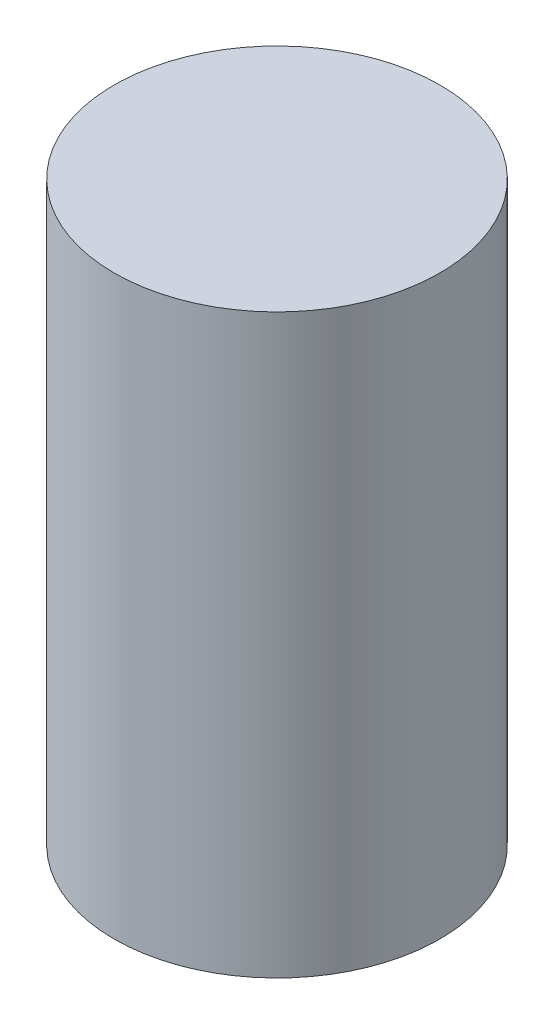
ISO-10303-21;
HEADER;
FILE_DESCRIPTION(('STEP AP214'),'2;1');
FILE_NAME('part.step','',(''),(''),'','','');
FILE_SCHEMA(('AUTOMOTIVE_DESIGN { 1 0 10303 214 1 1 1 1 }'));
ENDSEC;
DATA;
#1=APPLICATION_CONTEXT('core data for automotive mechanical design processes');
#2=APPLICATION_PROTOCOL_DEFINITION('international standard','automotive_design',2000,#1);
#3=PRODUCT_CONTEXT('',#1,'mechanical');
#4=PRODUCT('Part','Part','',(#3));
#5=PRODUCT_RELATED_PRODUCT_CATEGORY('part','',(#4));
#6=PRODUCT_DEFINITION_FORMATION('','',#4);
#7=PRODUCT_DEFINITION_CONTEXT('part definition',#1,'design');
#8=PRODUCT_DEFINITION('design','',#6,#7);
#9=PRODUCT_DEFINITION_SHAPE('','',#8);
#10=(LENGTH_UNIT() NAMED_UNIT(*) SI_UNIT(.MILLI.,.METRE.));
#11=(NAMED_UNIT(*) PLANE_ANGLE_UNIT() SI_UNIT($,.RADIAN.));
#12=(NAMED_UNIT(*) SI_UNIT($,.STERADIAN.) SOLID_ANGLE_UNIT());
#13=UNCERTAINTY_MEASURE_WITH_UNIT(LENGTH_MEASURE(1.E-05),#10,'distance_accuracy_value','');
#14=(GEOMETRIC_REPRESENTATION_CONTEXT(3) GLOBAL_UNCERTAINTY_ASSIGNED_CONTEXT((#13)) GLOBAL_UNIT_ASSIGNED_CONTEXT((#10,
#11,#12)) REPRESENTATION_CONTEXT('',''));
#15=CARTESIAN_POINT('',(0.,0.,0.));
#16=DIRECTION('',(0.,0.,1.));
#17=DIRECTION('',(1.,0.,0.));
#18=AXIS2_PLACEMENT_3D('',#15,#16,#17);
#19=CARTESIAN_POINT('',(0.,4.25,0.));
#20=DIRECTION('',(0.,1.,0.));
#21=DIRECTION('',(0.,0.,1.));
#22=AXIS2_PLACEMENT_3D('',#19,#20,#21);
#23=PLANE('',#22);
#24=CARTESIAN_POINT('',(0.,4.25,0.));
#25=DIRECTION('',(0.,1.,0.));
#26=DIRECTION('',(0.,0.,1.));
#27=AXIS2_PLACEMENT_3D('',#24,#25,#26);
#28=CIRCLE('',#27,1.2);
#29=CARTESIAN_POINT('',(0.,4.25,1.2));
#30=VERTEX_POINT('',#29);
#31=EDGE_CURVE('E18',#30,#30,#28,.F.);
#32=ORIENTED_EDGE('',*,*,#31,.F.);
#33=EDGE_LOOP('',(#32));
#34=FACE_BOUND('',#33,.T.);
#35=ADVANCED_FACE('F15',(#34),#23,.T.);
#36=CARTESIAN_POINT('',(0.,0.,0.));
#37=DIRECTION('',(0.,1.,0.));
#38=DIRECTION('',(0.,0.,1.));
#39=AXIS2_PLACEMENT_3D('',#36,#37,#38);
#40=PLANE('',#39);
#41=CARTESIAN_POINT('',(0.,0.,0.));
#42=DIRECTION('',(0.,1.,0.));
#43=DIRECTION('',(0.,0.,1.));
#44=AXIS2_PLACEMENT_3D('',#41,#42,#43);
#45=CIRCLE('',#44,1.2);
#46=CARTESIAN_POINT('',(0.,0.,1.2));
#47=VERTEX_POINT('',#46);
#48=EDGE_CURVE('E10',#47,#47,#45,.T.);
#49=ORIENTED_EDGE('',*,*,#48,.F.);
#50=EDGE_LOOP('',(#49));
#51=FACE_BOUND('',#50,.T.);
#52=ADVANCED_FACE('F30',(#51),#40,.F.);
#53=CARTESIAN_POINT('',(0.,0.,0.));
#54=DIRECTION('',(0.,1.,0.));
#55=DIRECTION('',(0.,0.,1.));
#56=AXIS2_PLACEMENT_3D('',#53,#54,#55);
#57=CYLINDRICAL_SURFACE('',#56,1.2);
#58=ORIENTED_EDGE('',*,*,#31,.T.);
#59=EDGE_LOOP('',(#58));
#60=FACE_BOUND('',#59,.T.);
#61=ORIENTED_EDGE('',*,*,#48,.T.);
#62=EDGE_LOOP('',(#61));
#63=FACE_BOUND('',#62,.T.);
#64=ADVANCED_FACE('F27',(#60,#63),#57,.T.);
#65=CLOSED_SHELL('',(#35,#52,#64));
#66=MANIFOLD_SOLID_BREP('B1',#65);
#67=ADVANCED_BREP_SHAPE_REPRESENTATION('',(#18,#66),#14);
#68=SHAPE_DEFINITION_REPRESENTATION(#9,#67);
ENDSEC;
END-ISO-10303-21;
